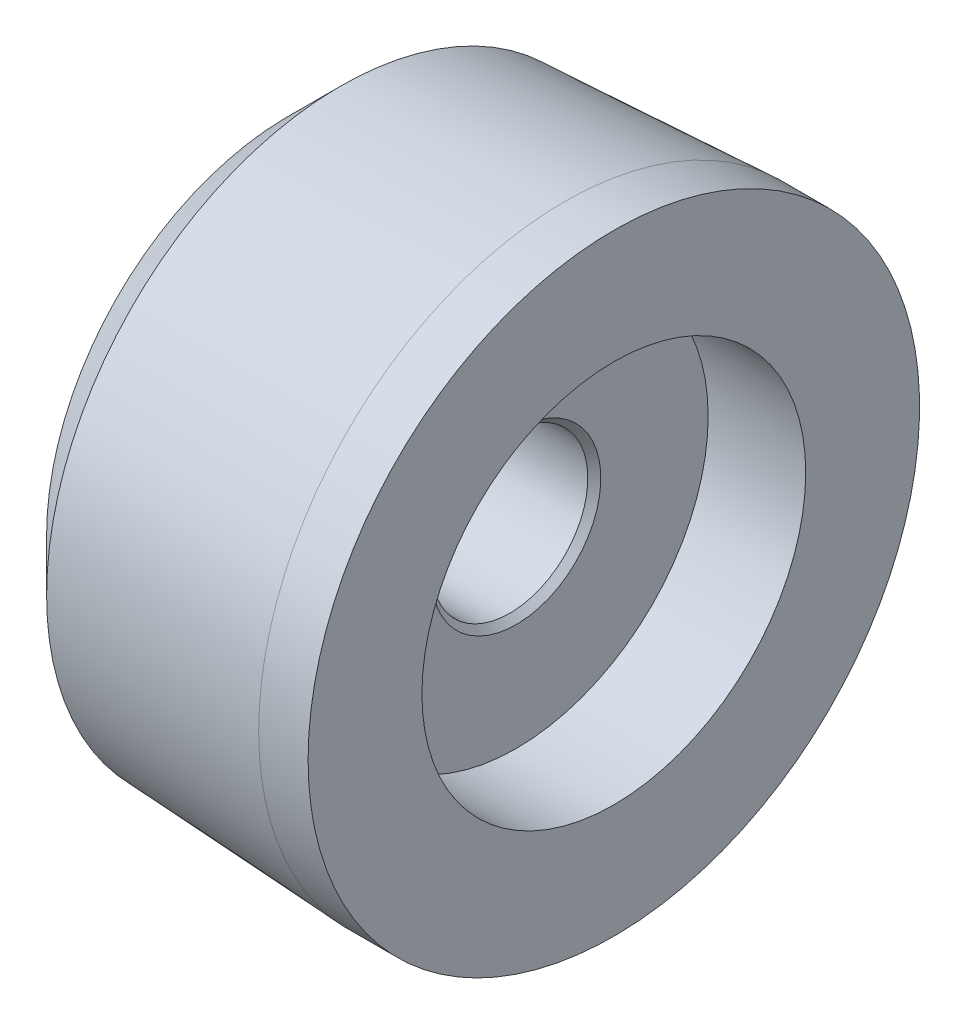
ISO-10303-21;
HEADER;
FILE_DESCRIPTION(('STEP AP214'),'2;1');
FILE_NAME('part.step','',(''),(''),'','','');
FILE_SCHEMA(('AUTOMOTIVE_DESIGN { 1 0 10303 214 1 1 1 1 }'));
ENDSEC;
DATA;
#1=APPLICATION_CONTEXT('core data for automotive mechanical design processes');
#2=APPLICATION_PROTOCOL_DEFINITION('international standard','automotive_design',2000,#1);
#3=PRODUCT_CONTEXT('',#1,'mechanical');
#4=PRODUCT('Part','Part','',(#3));
#5=PRODUCT_RELATED_PRODUCT_CATEGORY('part','',(#4));
#6=PRODUCT_DEFINITION_FORMATION('','',#4);
#7=PRODUCT_DEFINITION_CONTEXT('part definition',#1,'design');
#8=PRODUCT_DEFINITION('design','',#6,#7);
#9=PRODUCT_DEFINITION_SHAPE('','',#8);
#10=(LENGTH_UNIT() NAMED_UNIT(*) SI_UNIT(.MILLI.,.METRE.));
#11=(NAMED_UNIT(*) PLANE_ANGLE_UNIT() SI_UNIT($,.RADIAN.));
#12=(NAMED_UNIT(*) SI_UNIT($,.STERADIAN.) SOLID_ANGLE_UNIT());
#13=UNCERTAINTY_MEASURE_WITH_UNIT(LENGTH_MEASURE(1.E-05),#10,'distance_accuracy_value','');
#14=(GEOMETRIC_REPRESENTATION_CONTEXT(3) GLOBAL_UNCERTAINTY_ASSIGNED_CONTEXT((#13)) GLOBAL_UNIT_ASSIGNED_CONTEXT((#10,
#11,#12)) REPRESENTATION_CONTEXT('',''));
#15=CARTESIAN_POINT('',(0.,0.,0.));
#16=DIRECTION('',(0.,0.,1.));
#17=DIRECTION('',(1.,0.,0.));
#18=AXIS2_PLACEMENT_3D('',#15,#16,#17);
#19=CARTESIAN_POINT('',(5.,14.75,0.));
#20=DIRECTION('',(1.,0.,0.));
#21=DIRECTION('',(0.,0.,-1.));
#22=AXIS2_PLACEMENT_3D('',#19,#20,#21);
#23=PLANE('',#22);
#24=CARTESIAN_POINT('',(5.,0.,0.));
#25=DIRECTION('',(-1.,0.,0.));
#26=DIRECTION('',(0.,0.,1.));
#27=AXIS2_PLACEMENT_3D('',#24,#25,#26);
#28=CIRCLE('',#27,6.49993297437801);
#29=CARTESIAN_POINT('',(5.,0.,6.49993297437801));
#30=VERTEX_POINT('',#29);
#31=EDGE_CURVE('E10',#30,#30,#28,.T.);
#32=ORIENTED_EDGE('',*,*,#31,.T.);
#33=EDGE_LOOP('',(#32));
#34=FACE_BOUND('',#33,.T.);
#35=CARTESIAN_POINT('',(5.,0.,0.));
#36=DIRECTION('',(-1.,0.,0.));
#37=DIRECTION('',(0.,0.,1.));
#38=AXIS2_PLACEMENT_3D('',#35,#36,#37);
#39=CIRCLE('',#38,14.75);
#40=CARTESIAN_POINT('',(5.,0.,14.75));
#41=VERTEX_POINT('',#40);
#42=EDGE_CURVE('E73',#41,#41,#39,.T.);
#43=ORIENTED_EDGE('',*,*,#42,.F.);
#44=EDGE_LOOP('',(#43));
#45=FACE_BOUND('',#44,.T.);
#46=ADVANCED_FACE('F33',(#34,#45),#23,.T.);
#47=CARTESIAN_POINT('',(5.,0.,0.));
#48=DIRECTION('',(1.,0.,0.));
#49=DIRECTION('',(0.,0.,-1.));
#50=AXIS2_PLACEMENT_3D('',#47,#48,#49);
#51=CONICAL_SURFACE('',#50,6.49993297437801,0.785393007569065);
#52=CARTESIAN_POINT('',(4.50006187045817,0.,0.));
#53=DIRECTION('',(-1.,0.,0.));
#54=DIRECTION('',(0.,0.,1.));
#55=AXIS2_PLACEMENT_3D('',#52,#53,#54);
#56=CIRCLE('',#55,6.);
#57=CARTESIAN_POINT('',(4.50006187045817,0.,6.));
#58=VERTEX_POINT('',#57);
#59=EDGE_CURVE('E39',#58,#58,#56,.T.);
#60=ORIENTED_EDGE('',*,*,#59,.T.);
#61=EDGE_LOOP('',(#60));
#62=FACE_BOUND('',#61,.T.);
#63=ORIENTED_EDGE('',*,*,#31,.F.);
#64=EDGE_LOOP('',(#63));
#65=FACE_BOUND('',#64,.T.);
#66=ADVANCED_FACE('F81',(#62,#65),#51,.F.);
#67=CARTESIAN_POINT('',(12.5,0.,0.));
#68=DIRECTION('',(-1.,0.,0.));
#69=DIRECTION('',(0.,0.,1.));
#70=AXIS2_PLACEMENT_3D('',#67,#68,#69);
#71=CYLINDRICAL_SURFACE('',#70,6.);
#72=CARTESIAN_POINT('',(-4.5000563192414,0.,0.));
#73=DIRECTION('',(-1.,0.,0.));
#74=DIRECTION('',(0.,0.,1.));
#75=AXIS2_PLACEMENT_3D('',#72,#73,#74);
#76=CIRCLE('',#75,6.);
#77=CARTESIAN_POINT('',(-4.5000563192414,0.,6.));
#78=VERTEX_POINT('',#77);
#79=EDGE_CURVE('E43',#78,#78,#76,.T.);
#80=ORIENTED_EDGE('',*,*,#79,.T.);
#81=EDGE_LOOP('',(#80));
#82=FACE_BOUND('',#81,.T.);
#83=ORIENTED_EDGE('',*,*,#59,.F.);
#84=EDGE_LOOP('',(#83));
#85=FACE_BOUND('',#84,.T.);
#86=ADVANCED_FACE('F85',(#82,#85),#71,.F.);
#87=CARTESIAN_POINT('',(-4.5000563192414,0.,0.));
#88=DIRECTION('',(-1.,0.,0.));
#89=DIRECTION('',(0.,0.,1.));
#90=AXIS2_PLACEMENT_3D('',#87,#88,#89);
#91=CONICAL_SURFACE('',#90,6.,0.785393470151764);
#92=CARTESIAN_POINT('',(-5.,0.,0.));
#93=DIRECTION('',(-1.,0.,0.));
#94=DIRECTION('',(0.,0.,1.));
#95=AXIS2_PLACEMENT_3D('',#92,#93,#94);
#96=CIRCLE('',#95,6.49993898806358);
#97=CARTESIAN_POINT('',(-5.,0.,6.49993898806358));
#98=VERTEX_POINT('',#97);
#99=EDGE_CURVE('E47',#98,#98,#96,.T.);
#100=ORIENTED_EDGE('',*,*,#99,.T.);
#101=EDGE_LOOP('',(#100));
#102=FACE_BOUND('',#101,.T.);
#103=ORIENTED_EDGE('',*,*,#79,.F.);
#104=EDGE_LOOP('',(#103));
#105=FACE_BOUND('',#104,.T.);
#106=ADVANCED_FACE('F89',(#102,#105),#91,.F.);
#107=CARTESIAN_POINT('',(-5.,6.49993898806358,0.));
#108=DIRECTION('',(-1.,0.,0.));
#109=DIRECTION('',(0.,0.,1.));
#110=AXIS2_PLACEMENT_3D('',#107,#108,#109);
#111=PLANE('',#110);
#112=CARTESIAN_POINT('',(-5.,0.,0.));
#113=DIRECTION('',(-1.,0.,0.));
#114=DIRECTION('',(0.,0.,1.));
#115=AXIS2_PLACEMENT_3D('',#112,#113,#114);
#116=CIRCLE('',#115,14.75);
#117=CARTESIAN_POINT('',(-5.,0.,14.75));
#118=VERTEX_POINT('',#117);
#119=EDGE_CURVE('E52',#118,#118,#116,.T.);
#120=ORIENTED_EDGE('',*,*,#119,.T.);
#121=EDGE_LOOP('',(#120));
#122=FACE_BOUND('',#121,.T.);
#123=ORIENTED_EDGE('',*,*,#99,.F.);
#124=EDGE_LOOP('',(#123));
#125=FACE_BOUND('',#124,.T.);
#126=ADVANCED_FACE('F96',(#122,#125),#111,.T.);
#127=CARTESIAN_POINT('',(12.5,0.,0.));
#128=DIRECTION('',(-1.,0.,0.));
#129=DIRECTION('',(0.,0.,1.));
#130=AXIS2_PLACEMENT_3D('',#127,#128,#129);
#131=CYLINDRICAL_SURFACE('',#130,14.75);
#132=CARTESIAN_POINT('',(-12.5000000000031,0.,0.));
#133=DIRECTION('',(-1.,0.,0.));
#134=DIRECTION('',(0.,0.,1.));
#135=AXIS2_PLACEMENT_3D('',#132,#133,#134);
#136=CIRCLE('',#135,14.75);
#137=CARTESIAN_POINT('',(-12.5000000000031,0.,14.75));
#138=VERTEX_POINT('',#137);
#139=EDGE_CURVE('E55',#138,#138,#136,.T.);
#140=ORIENTED_EDGE('',*,*,#139,.T.);
#141=EDGE_LOOP('',(#140));
#142=FACE_BOUND('',#141,.T.);
#143=ORIENTED_EDGE('',*,*,#119,.F.);
#144=EDGE_LOOP('',(#143));
#145=FACE_BOUND('',#144,.T.);
#146=ADVANCED_FACE('F100',(#142,#145),#131,.F.);
#147=CARTESIAN_POINT('',(-12.5000000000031,14.75,0.));
#148=DIRECTION('',(-1.,0.,0.));
#149=DIRECTION('',(0.,0.,1.));
#150=AXIS2_PLACEMENT_3D('',#147,#148,#149);
#151=PLANE('',#150);
#152=CARTESIAN_POINT('',(-12.5000000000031,0.,0.));
#153=DIRECTION('',(-1.,0.,0.));
#154=DIRECTION('',(0.,0.,1.));
#155=AXIS2_PLACEMENT_3D('',#152,#153,#154);
#156=CIRCLE('',#155,18.5985861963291);
#157=CARTESIAN_POINT('',(-12.5000000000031,0.,18.5985861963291));
#158=VERTEX_POINT('',#157);
#159=EDGE_CURVE('E58',#158,#158,#156,.T.);
#160=ORIENTED_EDGE('',*,*,#159,.T.);
#161=EDGE_LOOP('',(#160));
#162=FACE_BOUND('',#161,.T.);
#163=ORIENTED_EDGE('',*,*,#139,.F.);
#164=EDGE_LOOP('',(#163));
#165=FACE_BOUND('',#164,.T.);
#166=ADVANCED_FACE('F104',(#162,#165),#151,.T.);
#167=CARTESIAN_POINT('',(-12.5000000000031,0.,0.));
#168=DIRECTION('',(1.,0.,0.));
#169=DIRECTION('',(0.,0.,-1.));
#170=AXIS2_PLACEMENT_3D('',#167,#168,#169);
#171=CONICAL_SURFACE('',#170,18.5985861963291,0.785398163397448);
#172=CARTESIAN_POINT('',(-8.50000000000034,0.,0.));
#173=DIRECTION('',(-1.,0.,0.));
#174=DIRECTION('',(0.,0.,1.));
#175=AXIS2_PLACEMENT_3D('',#172,#173,#174);
#176=CIRCLE('',#175,22.5985861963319);
#177=CARTESIAN_POINT('',(-8.50000000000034,0.,22.5985861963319));
#178=VERTEX_POINT('',#177);
#179=EDGE_CURVE('E61',#178,#178,#176,.T.);
#180=ORIENTED_EDGE('',*,*,#179,.T.);
#181=EDGE_LOOP('',(#180));
#182=FACE_BOUND('',#181,.T.);
#183=ORIENTED_EDGE('',*,*,#159,.F.);
#184=EDGE_LOOP('',(#183));
#185=FACE_BOUND('',#184,.T.);
#186=ADVANCED_FACE('F108',(#182,#185),#171,.T.);
#187=CARTESIAN_POINT('',(-8.50000000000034,0.,0.));
#188=DIRECTION('',(1.,0.,0.));
#189=DIRECTION('',(0.,0.,-1.));
#190=AXIS2_PLACEMENT_3D('',#187,#188,#189);
#191=CONICAL_SURFACE('',#190,22.5985861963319,0.0523598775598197);
#192=CARTESIAN_POINT('',(8.69999999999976,0.,0.));
#193=DIRECTION('',(-1.,0.,0.));
#194=DIRECTION('',(0.,0.,1.));
#195=AXIS2_PLACEMENT_3D('',#192,#193,#194);
#196=CIRCLE('',#195,23.5);
#197=CARTESIAN_POINT('',(8.69999999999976,0.,23.5));
#198=VERTEX_POINT('',#197);
#199=EDGE_CURVE('E64',#198,#198,#196,.T.);
#200=ORIENTED_EDGE('',*,*,#199,.T.);
#201=EDGE_LOOP('',(#200));
#202=FACE_BOUND('',#201,.T.);
#203=ORIENTED_EDGE('',*,*,#179,.F.);
#204=EDGE_LOOP('',(#203));
#205=FACE_BOUND('',#204,.T.);
#206=ADVANCED_FACE('F112',(#202,#205),#191,.T.);
#207=CARTESIAN_POINT('',(12.5,0.,0.));
#208=DIRECTION('',(-1.,0.,0.));
#209=DIRECTION('',(0.,0.,1.));
#210=AXIS2_PLACEMENT_3D('',#207,#208,#209);
#211=CYLINDRICAL_SURFACE('',#210,23.5);
#212=CARTESIAN_POINT('',(12.5,0.,0.));
#213=DIRECTION('',(-1.,0.,0.));
#214=DIRECTION('',(0.,0.,1.));
#215=AXIS2_PLACEMENT_3D('',#212,#213,#214);
#216=CIRCLE('',#215,23.5);
#217=CARTESIAN_POINT('',(12.5,0.,23.5));
#218=VERTEX_POINT('',#217);
#219=EDGE_CURVE('E67',#218,#218,#216,.T.);
#220=ORIENTED_EDGE('',*,*,#219,.T.);
#221=EDGE_LOOP('',(#220));
#222=FACE_BOUND('',#221,.T.);
#223=ORIENTED_EDGE('',*,*,#199,.F.);
#224=EDGE_LOOP('',(#223));
#225=FACE_BOUND('',#224,.T.);
#226=ADVANCED_FACE('F116',(#222,#225),#211,.T.);
#227=CARTESIAN_POINT('',(12.5,23.5,0.));
#228=DIRECTION('',(1.,0.,0.));
#229=DIRECTION('',(0.,0.,-1.));
#230=AXIS2_PLACEMENT_3D('',#227,#228,#229);
#231=PLANE('',#230);
#232=CARTESIAN_POINT('',(12.5,0.,0.));
#233=DIRECTION('',(-1.,0.,0.));
#234=DIRECTION('',(0.,0.,1.));
#235=AXIS2_PLACEMENT_3D('',#232,#233,#234);
#236=CIRCLE('',#235,14.75);
#237=CARTESIAN_POINT('',(12.5,0.,14.75));
#238=VERTEX_POINT('',#237);
#239=EDGE_CURVE('E70',#238,#238,#236,.T.);
#240=ORIENTED_EDGE('',*,*,#239,.T.);
#241=EDGE_LOOP('',(#240));
#242=FACE_BOUND('',#241,.T.);
#243=ORIENTED_EDGE('',*,*,#219,.F.);
#244=EDGE_LOOP('',(#243));
#245=FACE_BOUND('',#244,.T.);
#246=ADVANCED_FACE('F120',(#242,#245),#231,.T.);
#247=CARTESIAN_POINT('',(12.5,0.,0.));
#248=DIRECTION('',(-1.,0.,0.));
#249=DIRECTION('',(0.,0.,1.));
#250=AXIS2_PLACEMENT_3D('',#247,#248,#249);
#251=CYLINDRICAL_SURFACE('',#250,14.75);
#252=ORIENTED_EDGE('',*,*,#42,.T.);
#253=EDGE_LOOP('',(#252));
#254=FACE_BOUND('',#253,.T.);
#255=ORIENTED_EDGE('',*,*,#239,.F.);
#256=EDGE_LOOP('',(#255));
#257=FACE_BOUND('',#256,.T.);
#258=ADVANCED_FACE('F77',(#254,#257),#251,.F.);
#259=CLOSED_SHELL('',(#46,#66,#86,#106,#126,#146,#166,#186,#206,#226,#246,#258));
#260=MANIFOLD_SOLID_BREP('B2',#259);
#261=ADVANCED_BREP_SHAPE_REPRESENTATION('',(#18,#260),#14);
#262=SHAPE_DEFINITION_REPRESENTATION(#9,#261);
ENDSEC;
END-ISO-10303-21;
